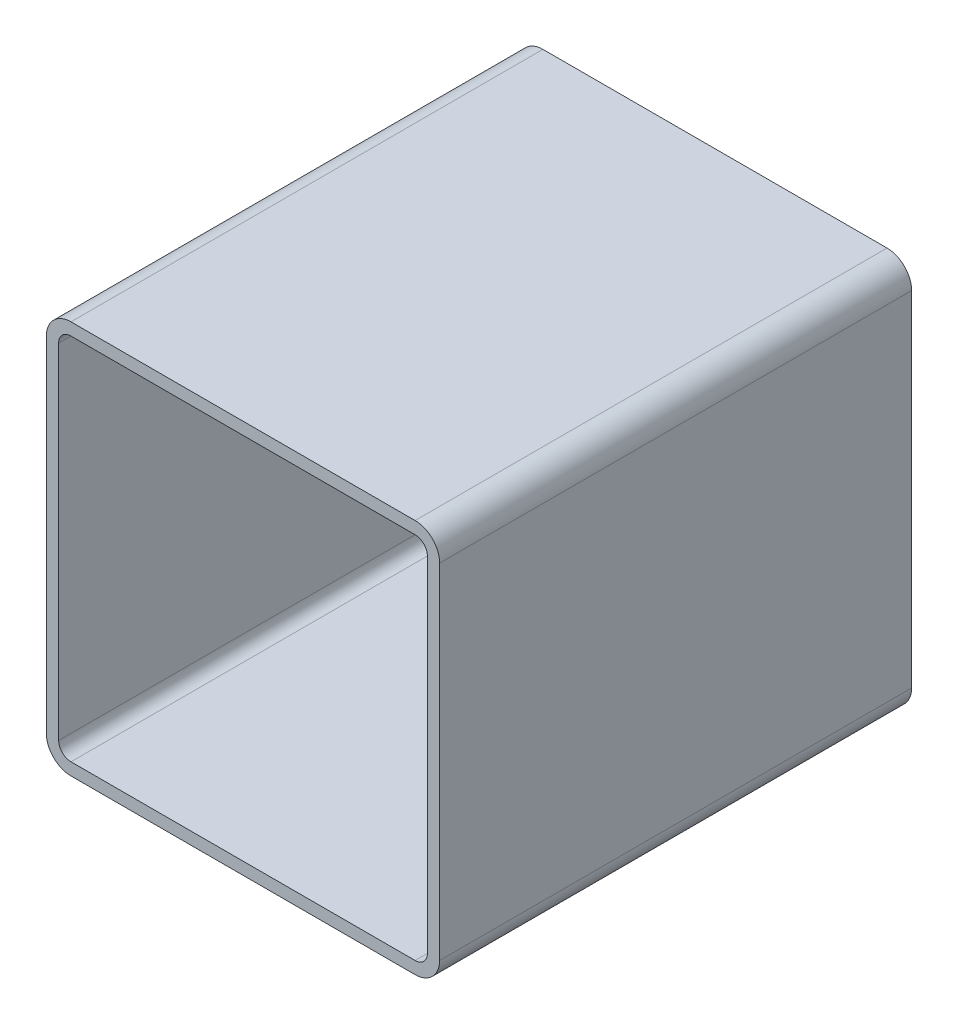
ISO-10303-21;
HEADER;
FILE_DESCRIPTION(('STEP AP214'),'2;1');
FILE_NAME('part.step','',(''),(''),'','','');
FILE_SCHEMA(('AUTOMOTIVE_DESIGN { 1 0 10303 214 1 1 1 1 }'));
ENDSEC;
DATA;
#1=APPLICATION_CONTEXT('core data for automotive mechanical design processes');
#2=APPLICATION_PROTOCOL_DEFINITION('international standard','automotive_design',2000,#1);
#3=PRODUCT_CONTEXT('',#1,'mechanical');
#4=PRODUCT('Part','Part','',(#3));
#5=PRODUCT_RELATED_PRODUCT_CATEGORY('part','',(#4));
#6=PRODUCT_DEFINITION_FORMATION('','',#4);
#7=PRODUCT_DEFINITION_CONTEXT('part definition',#1,'design');
#8=PRODUCT_DEFINITION('design','',#6,#7);
#9=PRODUCT_DEFINITION_SHAPE('','',#8);
#10=(LENGTH_UNIT() NAMED_UNIT(*) SI_UNIT(.MILLI.,.METRE.));
#11=(NAMED_UNIT(*) PLANE_ANGLE_UNIT() SI_UNIT($,.RADIAN.));
#12=(NAMED_UNIT(*) SI_UNIT($,.STERADIAN.) SOLID_ANGLE_UNIT());
#13=UNCERTAINTY_MEASURE_WITH_UNIT(LENGTH_MEASURE(1.E-05),#10,'distance_accuracy_value','');
#14=(GEOMETRIC_REPRESENTATION_CONTEXT(3) GLOBAL_UNCERTAINTY_ASSIGNED_CONTEXT((#13)) GLOBAL_UNIT_ASSIGNED_CONTEXT((#10,
#11,#12)) REPRESENTATION_CONTEXT('',''));
#15=CARTESIAN_POINT('',(0.,0.,0.));
#16=DIRECTION('',(0.,0.,1.));
#17=DIRECTION('',(1.,0.,0.));
#18=AXIS2_PLACEMENT_3D('',#15,#16,#17);
#19=CARTESIAN_POINT('',(18.6095794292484,240.045313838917,304.8));
#20=DIRECTION('',(0.,0.,1.));
#21=DIRECTION('',(1.,0.,0.));
#22=AXIS2_PLACEMENT_3D('',#19,#20,#21);
#23=PLANE('',#22);
#24=CARTESIAN_POINT('',(18.6095794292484,240.045313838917,304.8));
#25=DIRECTION('',(0.,0.,1.));
#26=DIRECTION('',(1.,0.,0.));
#27=AXIS2_PLACEMENT_3D('',#24,#25,#26);
#28=CIRCLE('',#27,15.875);
#29=CARTESIAN_POINT('',(18.6095794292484,255.920313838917,304.8));
#30=VERTEX_POINT('',#29);
#31=CARTESIAN_POINT('',(2.73457942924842,240.045313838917,304.8));
#32=VERTEX_POINT('',#31);
#33=EDGE_CURVE('E211',#30,#32,#28,.T.);
#34=ORIENTED_EDGE('',*,*,#33,.T.);
#35=DIRECTION('',(0.,-1.,0.));
#36=VECTOR('',#35,1.);
#37=CARTESIAN_POINT('',(2.73457942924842,17.7953138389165,304.8));
#38=LINE('',#37,#36);
#39=CARTESIAN_POINT('',(2.73457942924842,17.7953138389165,304.8));
#40=VERTEX_POINT('',#39);
#41=EDGE_CURVE('E214',#32,#40,#38,.T.);
#42=ORIENTED_EDGE('',*,*,#41,.T.);
#43=CARTESIAN_POINT('',(18.6095794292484,17.7953138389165,304.8));
#44=DIRECTION('',(0.,0.,1.));
#45=DIRECTION('',(1.,0.,0.));
#46=AXIS2_PLACEMENT_3D('',#43,#44,#45);
#47=CIRCLE('',#46,15.875);
#48=CARTESIAN_POINT('',(18.6095794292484,1.92031383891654,304.8));
#49=VERTEX_POINT('',#48);
#50=EDGE_CURVE('E217',#40,#49,#47,.T.);
#51=ORIENTED_EDGE('',*,*,#50,.T.);
#52=DIRECTION('',(1.,0.,0.));
#53=VECTOR('',#52,1.);
#54=CARTESIAN_POINT('',(240.859579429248,1.92031383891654,304.8));
#55=LINE('',#54,#53);
#56=CARTESIAN_POINT('',(240.859579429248,1.92031383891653,304.8));
#57=VERTEX_POINT('',#56);
#58=EDGE_CURVE('E219',#49,#57,#55,.T.);
#59=ORIENTED_EDGE('',*,*,#58,.T.);
#60=CARTESIAN_POINT('',(240.859579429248,17.7953138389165,304.8));
#61=DIRECTION('',(0.,0.,1.));
#62=DIRECTION('',(1.,0.,0.));
#63=AXIS2_PLACEMENT_3D('',#60,#61,#62);
#64=CIRCLE('',#63,15.875);
#65=CARTESIAN_POINT('',(256.734579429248,17.7953138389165,304.8));
#66=VERTEX_POINT('',#65);
#67=EDGE_CURVE('E221',#57,#66,#64,.T.);
#68=ORIENTED_EDGE('',*,*,#67,.T.);
#69=DIRECTION('',(0.,1.,0.));
#70=VECTOR('',#69,1.);
#71=CARTESIAN_POINT('',(256.734579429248,240.045313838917,304.8));
#72=LINE('',#71,#70);
#73=CARTESIAN_POINT('',(256.734579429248,240.045313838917,304.8));
#74=VERTEX_POINT('',#73);
#75=EDGE_CURVE('E223',#66,#74,#72,.T.);
#76=ORIENTED_EDGE('',*,*,#75,.T.);
#77=CARTESIAN_POINT('',(240.859579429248,240.045313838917,304.8));
#78=DIRECTION('',(0.,0.,1.));
#79=DIRECTION('',(1.,0.,0.));
#80=AXIS2_PLACEMENT_3D('',#77,#78,#79);
#81=CIRCLE('',#80,15.875);
#82=CARTESIAN_POINT('',(240.859579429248,255.920313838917,304.8));
#83=VERTEX_POINT('',#82);
#84=EDGE_CURVE('E225',#74,#83,#81,.T.);
#85=ORIENTED_EDGE('',*,*,#84,.T.);
#86=DIRECTION('',(-1.,0.,0.));
#87=VECTOR('',#86,1.);
#88=CARTESIAN_POINT('',(18.6095794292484,255.920313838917,304.8));
#89=LINE('',#88,#87);
#90=EDGE_CURVE('E227',#83,#30,#89,.T.);
#91=ORIENTED_EDGE('',*,*,#90,.T.);
#92=EDGE_LOOP('',(#34,#42,#51,#59,#68,#76,#85,#91));
#93=FACE_BOUND('',#92,.T.);
#94=DIRECTION('',(0.,-1.,0.));
#95=VECTOR('',#94,1.);
#96=CARTESIAN_POINT('',(10.6720794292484,17.7953138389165,304.8));
#97=LINE('',#96,#95);
#98=CARTESIAN_POINT('',(10.6720794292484,240.045313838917,304.8));
#99=VERTEX_POINT('',#98);
#100=CARTESIAN_POINT('',(10.6720794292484,17.7953138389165,304.8));
#101=VERTEX_POINT('',#100);
#102=EDGE_CURVE('E154',#99,#101,#97,.T.);
#103=ORIENTED_EDGE('',*,*,#102,.F.);
#104=CARTESIAN_POINT('',(18.6095794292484,240.045313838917,304.8));
#105=DIRECTION('',(0.,0.,1.));
#106=DIRECTION('',(1.,0.,0.));
#107=AXIS2_PLACEMENT_3D('',#104,#105,#106);
#108=CIRCLE('',#107,7.9375);
#109=CARTESIAN_POINT('',(18.6095794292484,247.982813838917,304.8));
#110=VERTEX_POINT('',#109);
#111=EDGE_CURVE('E146',#110,#99,#108,.T.);
#112=ORIENTED_EDGE('',*,*,#111,.F.);
#113=DIRECTION('',(-1.,0.,0.));
#114=VECTOR('',#113,1.);
#115=CARTESIAN_POINT('',(18.6095794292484,247.982813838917,304.8));
#116=LINE('',#115,#114);
#117=CARTESIAN_POINT('',(240.859579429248,247.982813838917,304.8));
#118=VERTEX_POINT('',#117);
#119=EDGE_CURVE('E179',#118,#110,#116,.T.);
#120=ORIENTED_EDGE('',*,*,#119,.F.);
#121=CARTESIAN_POINT('',(240.859579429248,240.045313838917,304.8));
#122=DIRECTION('',(0.,0.,1.));
#123=DIRECTION('',(1.,0.,0.));
#124=AXIS2_PLACEMENT_3D('',#121,#122,#123);
#125=CIRCLE('',#124,7.9375);
#126=CARTESIAN_POINT('',(248.797079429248,240.045313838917,304.8));
#127=VERTEX_POINT('',#126);
#128=EDGE_CURVE('E177',#127,#118,#125,.T.);
#129=ORIENTED_EDGE('',*,*,#128,.F.);
#130=DIRECTION('',(0.,1.,0.));
#131=VECTOR('',#130,1.);
#132=CARTESIAN_POINT('',(248.797079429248,240.045313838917,304.8));
#133=LINE('',#132,#131);
#134=CARTESIAN_POINT('',(248.797079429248,17.7953138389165,304.8));
#135=VERTEX_POINT('',#134);
#136=EDGE_CURVE('E175',#135,#127,#133,.T.);
#137=ORIENTED_EDGE('',*,*,#136,.F.);
#138=CARTESIAN_POINT('',(240.859579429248,17.7953138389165,304.8));
#139=DIRECTION('',(0.,0.,1.));
#140=DIRECTION('',(1.,0.,0.));
#141=AXIS2_PLACEMENT_3D('',#138,#139,#140);
#142=CIRCLE('',#141,7.93750000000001);
#143=CARTESIAN_POINT('',(240.859579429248,9.85781383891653,304.8));
#144=VERTEX_POINT('',#143);
#145=EDGE_CURVE('E173',#144,#135,#142,.T.);
#146=ORIENTED_EDGE('',*,*,#145,.F.);
#147=DIRECTION('',(1.,0.,0.));
#148=VECTOR('',#147,1.);
#149=CARTESIAN_POINT('',(240.859579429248,9.85781383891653,304.8));
#150=LINE('',#149,#148);
#151=CARTESIAN_POINT('',(18.6095794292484,9.85781383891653,304.8));
#152=VERTEX_POINT('',#151);
#153=EDGE_CURVE('E169',#152,#144,#150,.T.);
#154=ORIENTED_EDGE('',*,*,#153,.F.);
#155=CARTESIAN_POINT('',(18.6095794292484,17.7953138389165,304.8));
#156=DIRECTION('',(0.,0.,1.));
#157=DIRECTION('',(1.,0.,0.));
#158=AXIS2_PLACEMENT_3D('',#155,#156,#157);
#159=CIRCLE('',#158,7.9375);
#160=EDGE_CURVE('E167',#101,#152,#159,.T.);
#161=ORIENTED_EDGE('',*,*,#160,.F.);
#162=EDGE_LOOP('',(#103,#112,#120,#129,#137,#146,#154,#161));
#163=FACE_BOUND('',#162,.T.);
#164=ADVANCED_FACE('F33',(#93,#163),#23,.T.);
#165=CARTESIAN_POINT('',(18.6095794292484,240.045313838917,0.));
#166=DIRECTION('',(0.,0.,1.));
#167=DIRECTION('',(1.,0.,0.));
#168=AXIS2_PLACEMENT_3D('',#165,#166,#167);
#169=PLANE('',#168);
#170=CARTESIAN_POINT('',(18.6095794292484,240.045313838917,0.));
#171=DIRECTION('',(0.,0.,1.));
#172=DIRECTION('',(1.,0.,0.));
#173=AXIS2_PLACEMENT_3D('',#170,#171,#172);
#174=CIRCLE('',#173,15.875);
#175=CARTESIAN_POINT('',(18.6095794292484,255.920313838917,0.));
#176=VERTEX_POINT('',#175);
#177=CARTESIAN_POINT('',(2.73457942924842,240.045313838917,0.));
#178=VERTEX_POINT('',#177);
#179=EDGE_CURVE('E162',#176,#178,#174,.T.);
#180=ORIENTED_EDGE('',*,*,#179,.F.);
#181=DIRECTION('',(-1.,0.,0.));
#182=VECTOR('',#181,1.);
#183=CARTESIAN_POINT('',(18.6095794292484,255.920313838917,0.));
#184=LINE('',#183,#182);
#185=CARTESIAN_POINT('',(240.859579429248,255.920313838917,0.));
#186=VERTEX_POINT('',#185);
#187=EDGE_CURVE('E215',#186,#176,#184,.T.);
#188=ORIENTED_EDGE('',*,*,#187,.F.);
#189=CARTESIAN_POINT('',(240.859579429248,240.045313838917,0.));
#190=DIRECTION('',(0.,0.,1.));
#191=DIRECTION('',(1.,0.,0.));
#192=AXIS2_PLACEMENT_3D('',#189,#190,#191);
#193=CIRCLE('',#192,15.875);
#194=CARTESIAN_POINT('',(256.734579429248,240.045313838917,0.));
#195=VERTEX_POINT('',#194);
#196=EDGE_CURVE('E242',#195,#186,#193,.T.);
#197=ORIENTED_EDGE('',*,*,#196,.F.);
#198=DIRECTION('',(0.,1.,0.));
#199=VECTOR('',#198,1.);
#200=CARTESIAN_POINT('',(256.734579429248,240.045313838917,0.));
#201=LINE('',#200,#199);
#202=CARTESIAN_POINT('',(256.734579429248,17.7953138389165,0.));
#203=VERTEX_POINT('',#202);
#204=EDGE_CURVE('E240',#203,#195,#201,.T.);
#205=ORIENTED_EDGE('',*,*,#204,.F.);
#206=CARTESIAN_POINT('',(240.859579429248,17.7953138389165,0.));
#207=DIRECTION('',(0.,0.,1.));
#208=DIRECTION('',(1.,0.,0.));
#209=AXIS2_PLACEMENT_3D('',#206,#207,#208);
#210=CIRCLE('',#209,15.875);
#211=CARTESIAN_POINT('',(240.859579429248,1.92031383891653,0.));
#212=VERTEX_POINT('',#211);
#213=EDGE_CURVE('E238',#212,#203,#210,.T.);
#214=ORIENTED_EDGE('',*,*,#213,.F.);
#215=DIRECTION('',(1.,0.,0.));
#216=VECTOR('',#215,1.);
#217=CARTESIAN_POINT('',(240.859579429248,1.92031383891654,0.));
#218=LINE('',#217,#216);
#219=CARTESIAN_POINT('',(18.6095794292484,1.92031383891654,0.));
#220=VERTEX_POINT('',#219);
#221=EDGE_CURVE('E236',#220,#212,#218,.T.);
#222=ORIENTED_EDGE('',*,*,#221,.F.);
#223=CARTESIAN_POINT('',(18.6095794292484,17.7953138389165,0.));
#224=DIRECTION('',(0.,0.,1.));
#225=DIRECTION('',(1.,0.,0.));
#226=AXIS2_PLACEMENT_3D('',#223,#224,#225);
#227=CIRCLE('',#226,15.875);
#228=CARTESIAN_POINT('',(2.73457942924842,17.7953138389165,0.));
#229=VERTEX_POINT('',#228);
#230=EDGE_CURVE('E234',#229,#220,#227,.T.);
#231=ORIENTED_EDGE('',*,*,#230,.F.);
#232=DIRECTION('',(0.,-1.,0.));
#233=VECTOR('',#232,1.);
#234=CARTESIAN_POINT('',(2.73457942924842,17.7953138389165,0.));
#235=LINE('',#234,#233);
#236=EDGE_CURVE('E232',#178,#229,#235,.T.);
#237=ORIENTED_EDGE('',*,*,#236,.F.);
#238=EDGE_LOOP('',(#180,#188,#197,#205,#214,#222,#231,#237));
#239=FACE_BOUND('',#238,.T.);
#240=CARTESIAN_POINT('',(18.6095794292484,240.045313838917,0.));
#241=DIRECTION('',(0.,0.,1.));
#242=DIRECTION('',(1.,0.,0.));
#243=AXIS2_PLACEMENT_3D('',#240,#241,#242);
#244=CIRCLE('',#243,7.9375);
#245=CARTESIAN_POINT('',(18.6095794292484,247.982813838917,0.));
#246=VERTEX_POINT('',#245);
#247=CARTESIAN_POINT('',(10.6720794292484,240.045313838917,0.));
#248=VERTEX_POINT('',#247);
#249=EDGE_CURVE('E56',#246,#248,#244,.T.);
#250=ORIENTED_EDGE('',*,*,#249,.T.);
#251=DIRECTION('',(0.,-1.,0.));
#252=VECTOR('',#251,1.);
#253=CARTESIAN_POINT('',(10.6720794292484,17.7953138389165,0.));
#254=LINE('',#253,#252);
#255=CARTESIAN_POINT('',(10.6720794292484,17.7953138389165,0.));
#256=VERTEX_POINT('',#255);
#257=EDGE_CURVE('E161',#248,#256,#254,.T.);
#258=ORIENTED_EDGE('',*,*,#257,.T.);
#259=CARTESIAN_POINT('',(18.6095794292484,17.7953138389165,0.));
#260=DIRECTION('',(0.,0.,1.));
#261=DIRECTION('',(1.,0.,0.));
#262=AXIS2_PLACEMENT_3D('',#259,#260,#261);
#263=CIRCLE('',#262,7.9375);
#264=CARTESIAN_POINT('',(18.6095794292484,9.85781383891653,0.));
#265=VERTEX_POINT('',#264);
#266=EDGE_CURVE('E183',#256,#265,#263,.T.);
#267=ORIENTED_EDGE('',*,*,#266,.T.);
#268=DIRECTION('',(1.,0.,0.));
#269=VECTOR('',#268,1.);
#270=CARTESIAN_POINT('',(240.859579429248,9.85781383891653,0.));
#271=LINE('',#270,#269);
#272=CARTESIAN_POINT('',(240.859579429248,9.85781383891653,0.));
#273=VERTEX_POINT('',#272);
#274=EDGE_CURVE('E186',#265,#273,#271,.T.);
#275=ORIENTED_EDGE('',*,*,#274,.T.);
#276=CARTESIAN_POINT('',(240.859579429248,17.7953138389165,0.));
#277=DIRECTION('',(0.,0.,1.));
#278=DIRECTION('',(1.,0.,0.));
#279=AXIS2_PLACEMENT_3D('',#276,#277,#278);
#280=CIRCLE('',#279,7.93750000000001);
#281=CARTESIAN_POINT('',(248.797079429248,17.7953138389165,0.));
#282=VERTEX_POINT('',#281);
#283=EDGE_CURVE('E189',#273,#282,#280,.T.);
#284=ORIENTED_EDGE('',*,*,#283,.T.);
#285=DIRECTION('',(0.,1.,0.));
#286=VECTOR('',#285,1.);
#287=CARTESIAN_POINT('',(248.797079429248,240.045313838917,0.));
#288=LINE('',#287,#286);
#289=CARTESIAN_POINT('',(248.797079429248,240.045313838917,0.));
#290=VERTEX_POINT('',#289);
#291=EDGE_CURVE('E192',#282,#290,#288,.T.);
#292=ORIENTED_EDGE('',*,*,#291,.T.);
#293=CARTESIAN_POINT('',(240.859579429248,240.045313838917,0.));
#294=DIRECTION('',(0.,0.,1.));
#295=DIRECTION('',(1.,0.,0.));
#296=AXIS2_PLACEMENT_3D('',#293,#294,#295);
#297=CIRCLE('',#296,7.9375);
#298=CARTESIAN_POINT('',(240.859579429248,247.982813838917,0.));
#299=VERTEX_POINT('',#298);
#300=EDGE_CURVE('E195',#290,#299,#297,.T.);
#301=ORIENTED_EDGE('',*,*,#300,.T.);
#302=DIRECTION('',(-1.,0.,0.));
#303=VECTOR('',#302,1.);
#304=CARTESIAN_POINT('',(18.6095794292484,247.982813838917,0.));
#305=LINE('',#304,#303);
#306=EDGE_CURVE('E155',#299,#246,#305,.T.);
#307=ORIENTED_EDGE('',*,*,#306,.T.);
#308=EDGE_LOOP('',(#250,#258,#267,#275,#284,#292,#301,#307));
#309=FACE_BOUND('',#308,.T.);
#310=ADVANCED_FACE('F272',(#239,#309),#169,.F.);
#311=CARTESIAN_POINT('',(18.6095794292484,240.045313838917,304.8));
#312=DIRECTION('',(0.,0.,-1.));
#313=DIRECTION('',(-1.,0.,0.));
#314=AXIS2_PLACEMENT_3D('',#311,#312,#313);
#315=CYLINDRICAL_SURFACE('',#314,15.875);
#316=ORIENTED_EDGE('',*,*,#179,.T.);
#317=DIRECTION('',(0.,0.,-1.));
#318=VECTOR('',#317,1.);
#319=CARTESIAN_POINT('',(2.73457942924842,240.045313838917,304.8));
#320=LINE('',#319,#318);
#321=EDGE_CURVE('E11',#32,#178,#320,.T.);
#322=ORIENTED_EDGE('',*,*,#321,.F.);
#323=ORIENTED_EDGE('',*,*,#33,.F.);
#324=DIRECTION('',(0.,0.,-1.));
#325=VECTOR('',#324,1.);
#326=CARTESIAN_POINT('',(18.6095794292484,255.920313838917,304.8));
#327=LINE('',#326,#325);
#328=EDGE_CURVE('E229',#30,#176,#327,.T.);
#329=ORIENTED_EDGE('',*,*,#328,.T.);
#330=EDGE_LOOP('',(#316,#322,#323,#329));
#331=FACE_BOUND('',#330,.T.);
#332=ADVANCED_FACE('F35',(#331),#315,.T.);
#333=CARTESIAN_POINT('',(2.73457942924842,17.7953138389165,304.8));
#334=DIRECTION('',(1.,0.,0.));
#335=DIRECTION('',(0.,0.,-1.));
#336=AXIS2_PLACEMENT_3D('',#333,#334,#335);
#337=PLANE('',#336);
#338=ORIENTED_EDGE('',*,*,#236,.T.);
#339=DIRECTION('',(0.,0.,-1.));
#340=VECTOR('',#339,1.);
#341=CARTESIAN_POINT('',(2.73457942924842,17.7953138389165,304.8));
#342=LINE('',#341,#340);
#343=EDGE_CURVE('E41',#40,#229,#342,.T.);
#344=ORIENTED_EDGE('',*,*,#343,.F.);
#345=ORIENTED_EDGE('',*,*,#41,.F.);
#346=ORIENTED_EDGE('',*,*,#321,.T.);
#347=EDGE_LOOP('',(#338,#344,#345,#346));
#348=FACE_BOUND('',#347,.T.);
#349=ADVANCED_FACE('F289',(#348),#337,.F.);
#350=CARTESIAN_POINT('',(18.6095794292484,17.7953138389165,304.8));
#351=DIRECTION('',(0.,0.,-1.));
#352=DIRECTION('',(-1.,0.,0.));
#353=AXIS2_PLACEMENT_3D('',#350,#351,#352);
#354=CYLINDRICAL_SURFACE('',#353,15.875);
#355=ORIENTED_EDGE('',*,*,#230,.T.);
#356=DIRECTION('',(0.,0.,-1.));
#357=VECTOR('',#356,1.);
#358=CARTESIAN_POINT('',(18.6095794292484,1.92031383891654,304.8));
#359=LINE('',#358,#357);
#360=EDGE_CURVE('E259',#49,#220,#359,.T.);
#361=ORIENTED_EDGE('',*,*,#360,.F.);
#362=ORIENTED_EDGE('',*,*,#50,.F.);
#363=ORIENTED_EDGE('',*,*,#343,.T.);
#364=EDGE_LOOP('',(#355,#361,#362,#363));
#365=FACE_BOUND('',#364,.T.);
#366=ADVANCED_FACE('F266',(#365),#354,.T.);
#367=CARTESIAN_POINT('',(240.859579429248,1.92031383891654,304.8));
#368=DIRECTION('',(0.,1.,0.));
#369=DIRECTION('',(0.,0.,1.));
#370=AXIS2_PLACEMENT_3D('',#367,#368,#369);
#371=PLANE('',#370);
#372=ORIENTED_EDGE('',*,*,#221,.T.);
#373=DIRECTION('',(0.,0.,-1.));
#374=VECTOR('',#373,1.);
#375=CARTESIAN_POINT('',(240.859579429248,1.92031383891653,304.8));
#376=LINE('',#375,#374);
#377=EDGE_CURVE('E256',#57,#212,#376,.T.);
#378=ORIENTED_EDGE('',*,*,#377,.F.);
#379=ORIENTED_EDGE('',*,*,#58,.F.);
#380=ORIENTED_EDGE('',*,*,#360,.T.);
#381=EDGE_LOOP('',(#372,#378,#379,#380));
#382=FACE_BOUND('',#381,.T.);
#383=ADVANCED_FACE('F278',(#382),#371,.F.);
#384=CARTESIAN_POINT('',(240.859579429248,17.7953138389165,304.8));
#385=DIRECTION('',(0.,0.,-1.));
#386=DIRECTION('',(-1.,0.,0.));
#387=AXIS2_PLACEMENT_3D('',#384,#385,#386);
#388=CYLINDRICAL_SURFACE('',#387,15.875);
#389=ORIENTED_EDGE('',*,*,#213,.T.);
#390=DIRECTION('',(0.,0.,-1.));
#391=VECTOR('',#390,1.);
#392=CARTESIAN_POINT('',(256.734579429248,17.7953138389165,304.8));
#393=LINE('',#392,#391);
#394=EDGE_CURVE('E253',#66,#203,#393,.T.);
#395=ORIENTED_EDGE('',*,*,#394,.F.);
#396=ORIENTED_EDGE('',*,*,#67,.F.);
#397=ORIENTED_EDGE('',*,*,#377,.T.);
#398=EDGE_LOOP('',(#389,#395,#396,#397));
#399=FACE_BOUND('',#398,.T.);
#400=ADVANCED_FACE('F282',(#399),#388,.T.);
#401=CARTESIAN_POINT('',(256.734579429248,240.045313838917,304.8));
#402=DIRECTION('',(-1.,0.,0.));
#403=DIRECTION('',(0.,0.,1.));
#404=AXIS2_PLACEMENT_3D('',#401,#402,#403);
#405=PLANE('',#404);
#406=ORIENTED_EDGE('',*,*,#204,.T.);
#407=DIRECTION('',(0.,0.,-1.));
#408=VECTOR('',#407,1.);
#409=CARTESIAN_POINT('',(256.734579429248,240.045313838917,304.8));
#410=LINE('',#409,#408);
#411=EDGE_CURVE('E250',#74,#195,#410,.T.);
#412=ORIENTED_EDGE('',*,*,#411,.F.);
#413=ORIENTED_EDGE('',*,*,#75,.F.);
#414=ORIENTED_EDGE('',*,*,#394,.T.);
#415=EDGE_LOOP('',(#406,#412,#413,#414));
#416=FACE_BOUND('',#415,.T.);
#417=ADVANCED_FACE('F302',(#416),#405,.F.);
#418=CARTESIAN_POINT('',(240.859579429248,240.045313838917,304.8));
#419=DIRECTION('',(0.,0.,-1.));
#420=DIRECTION('',(-1.,0.,0.));
#421=AXIS2_PLACEMENT_3D('',#418,#419,#420);
#422=CYLINDRICAL_SURFACE('',#421,15.875);
#423=ORIENTED_EDGE('',*,*,#196,.T.);
#424=DIRECTION('',(0.,0.,-1.));
#425=VECTOR('',#424,1.);
#426=CARTESIAN_POINT('',(240.859579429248,255.920313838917,304.8));
#427=LINE('',#426,#425);
#428=EDGE_CURVE('E247',#83,#186,#427,.T.);
#429=ORIENTED_EDGE('',*,*,#428,.F.);
#430=ORIENTED_EDGE('',*,*,#84,.F.);
#431=ORIENTED_EDGE('',*,*,#411,.T.);
#432=EDGE_LOOP('',(#423,#429,#430,#431));
#433=FACE_BOUND('',#432,.T.);
#434=ADVANCED_FACE('F300',(#433),#422,.T.);
#435=CARTESIAN_POINT('',(18.6095794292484,255.920313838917,304.8));
#436=DIRECTION('',(0.,-1.,0.));
#437=DIRECTION('',(0.,0.,-1.));
#438=AXIS2_PLACEMENT_3D('',#435,#436,#437);
#439=PLANE('',#438);
#440=ORIENTED_EDGE('',*,*,#187,.T.);
#441=ORIENTED_EDGE('',*,*,#328,.F.);
#442=ORIENTED_EDGE('',*,*,#90,.F.);
#443=ORIENTED_EDGE('',*,*,#428,.T.);
#444=EDGE_LOOP('',(#440,#441,#442,#443));
#445=FACE_BOUND('',#444,.T.);
#446=ADVANCED_FACE('F295',(#445),#439,.F.);
#447=CARTESIAN_POINT('',(18.6095794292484,240.045313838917,304.8));
#448=DIRECTION('',(0.,0.,-1.));
#449=DIRECTION('',(-1.,0.,0.));
#450=AXIS2_PLACEMENT_3D('',#447,#448,#449);
#451=CYLINDRICAL_SURFACE('',#450,7.9375);
#452=ORIENTED_EDGE('',*,*,#249,.F.);
#453=DIRECTION('',(0.,0.,-1.));
#454=VECTOR('',#453,1.);
#455=CARTESIAN_POINT('',(18.6095794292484,247.982813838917,304.8));
#456=LINE('',#455,#454);
#457=EDGE_CURVE('E150',#110,#246,#456,.T.);
#458=ORIENTED_EDGE('',*,*,#457,.F.);
#459=ORIENTED_EDGE('',*,*,#111,.T.);
#460=DIRECTION('',(0.,0.,-1.));
#461=VECTOR('',#460,1.);
#462=CARTESIAN_POINT('',(10.6720794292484,240.045313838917,304.8));
#463=LINE('',#462,#461);
#464=EDGE_CURVE('E149',#99,#248,#463,.T.);
#465=ORIENTED_EDGE('',*,*,#464,.T.);
#466=EDGE_LOOP('',(#452,#458,#459,#465));
#467=FACE_BOUND('',#466,.T.);
#468=ADVANCED_FACE('F148',(#467),#451,.F.);
#469=CARTESIAN_POINT('',(10.6720794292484,17.7953138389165,304.8));
#470=DIRECTION('',(1.,0.,0.));
#471=DIRECTION('',(0.,0.,-1.));
#472=AXIS2_PLACEMENT_3D('',#469,#470,#471);
#473=PLANE('',#472);
#474=ORIENTED_EDGE('',*,*,#257,.F.);
#475=ORIENTED_EDGE('',*,*,#464,.F.);
#476=ORIENTED_EDGE('',*,*,#102,.T.);
#477=DIRECTION('',(0.,0.,-1.));
#478=VECTOR('',#477,1.);
#479=CARTESIAN_POINT('',(10.6720794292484,17.7953138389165,304.8));
#480=LINE('',#479,#478);
#481=EDGE_CURVE('E163',#101,#256,#480,.T.);
#482=ORIENTED_EDGE('',*,*,#481,.T.);
#483=EDGE_LOOP('',(#474,#475,#476,#482));
#484=FACE_BOUND('',#483,.T.);
#485=ADVANCED_FACE('F158',(#484),#473,.T.);
#486=CARTESIAN_POINT('',(18.6095794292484,17.7953138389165,304.8));
#487=DIRECTION('',(0.,0.,-1.));
#488=DIRECTION('',(-1.,0.,0.));
#489=AXIS2_PLACEMENT_3D('',#486,#487,#488);
#490=CYLINDRICAL_SURFACE('',#489,7.9375);
#491=ORIENTED_EDGE('',*,*,#266,.F.);
#492=ORIENTED_EDGE('',*,*,#481,.F.);
#493=ORIENTED_EDGE('',*,*,#160,.T.);
#494=DIRECTION('',(0.,0.,-1.));
#495=VECTOR('',#494,1.);
#496=CARTESIAN_POINT('',(18.6095794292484,9.85781383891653,304.8));
#497=LINE('',#496,#495);
#498=EDGE_CURVE('E208',#152,#265,#497,.T.);
#499=ORIENTED_EDGE('',*,*,#498,.T.);
#500=EDGE_LOOP('',(#491,#492,#493,#499));
#501=FACE_BOUND('',#500,.T.);
#502=ADVANCED_FACE('F327',(#501),#490,.F.);
#503=CARTESIAN_POINT('',(240.859579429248,9.85781383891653,304.8));
#504=DIRECTION('',(0.,1.,0.));
#505=DIRECTION('',(0.,0.,1.));
#506=AXIS2_PLACEMENT_3D('',#503,#504,#505);
#507=PLANE('',#506);
#508=ORIENTED_EDGE('',*,*,#274,.F.);
#509=ORIENTED_EDGE('',*,*,#498,.F.);
#510=ORIENTED_EDGE('',*,*,#153,.T.);
#511=DIRECTION('',(0.,0.,-1.));
#512=VECTOR('',#511,1.);
#513=CARTESIAN_POINT('',(240.859579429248,9.85781383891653,304.8));
#514=LINE('',#513,#512);
#515=EDGE_CURVE('E206',#144,#273,#514,.T.);
#516=ORIENTED_EDGE('',*,*,#515,.T.);
#517=EDGE_LOOP('',(#508,#509,#510,#516));
#518=FACE_BOUND('',#517,.T.);
#519=ADVANCED_FACE('F331',(#518),#507,.T.);
#520=CARTESIAN_POINT('',(240.859579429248,17.7953138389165,304.8));
#521=DIRECTION('',(0.,0.,-1.));
#522=DIRECTION('',(-1.,0.,0.));
#523=AXIS2_PLACEMENT_3D('',#520,#521,#522);
#524=CYLINDRICAL_SURFACE('',#523,7.93750000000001);
#525=ORIENTED_EDGE('',*,*,#283,.F.);
#526=ORIENTED_EDGE('',*,*,#515,.F.);
#527=ORIENTED_EDGE('',*,*,#145,.T.);
#528=DIRECTION('',(0.,0.,-1.));
#529=VECTOR('',#528,1.);
#530=CARTESIAN_POINT('',(248.797079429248,17.7953138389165,304.8));
#531=LINE('',#530,#529);
#532=EDGE_CURVE('E204',#135,#282,#531,.T.);
#533=ORIENTED_EDGE('',*,*,#532,.T.);
#534=EDGE_LOOP('',(#525,#526,#527,#533));
#535=FACE_BOUND('',#534,.T.);
#536=ADVANCED_FACE('F337',(#535),#524,.F.);
#537=CARTESIAN_POINT('',(248.797079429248,240.045313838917,304.8));
#538=DIRECTION('',(-1.,0.,0.));
#539=DIRECTION('',(0.,0.,1.));
#540=AXIS2_PLACEMENT_3D('',#537,#538,#539);
#541=PLANE('',#540);
#542=ORIENTED_EDGE('',*,*,#291,.F.);
#543=ORIENTED_EDGE('',*,*,#532,.F.);
#544=ORIENTED_EDGE('',*,*,#136,.T.);
#545=DIRECTION('',(0.,0.,-1.));
#546=VECTOR('',#545,1.);
#547=CARTESIAN_POINT('',(248.797079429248,240.045313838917,304.8));
#548=LINE('',#547,#546);
#549=EDGE_CURVE('E202',#127,#290,#548,.T.);
#550=ORIENTED_EDGE('',*,*,#549,.T.);
#551=EDGE_LOOP('',(#542,#543,#544,#550));
#552=FACE_BOUND('',#551,.T.);
#553=ADVANCED_FACE('F341',(#552),#541,.T.);
#554=CARTESIAN_POINT('',(240.859579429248,240.045313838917,304.8));
#555=DIRECTION('',(0.,0.,-1.));
#556=DIRECTION('',(-1.,0.,0.));
#557=AXIS2_PLACEMENT_3D('',#554,#555,#556);
#558=CYLINDRICAL_SURFACE('',#557,7.9375);
#559=ORIENTED_EDGE('',*,*,#300,.F.);
#560=ORIENTED_EDGE('',*,*,#549,.F.);
#561=ORIENTED_EDGE('',*,*,#128,.T.);
#562=DIRECTION('',(0.,0.,-1.));
#563=VECTOR('',#562,1.);
#564=CARTESIAN_POINT('',(240.859579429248,247.982813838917,304.8));
#565=LINE('',#564,#563);
#566=EDGE_CURVE('E48',#118,#299,#565,.T.);
#567=ORIENTED_EDGE('',*,*,#566,.T.);
#568=EDGE_LOOP('',(#559,#560,#561,#567));
#569=FACE_BOUND('',#568,.T.);
#570=ADVANCED_FACE('F345',(#569),#558,.F.);
#571=CARTESIAN_POINT('',(18.6095794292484,247.982813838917,304.8));
#572=DIRECTION('',(0.,-1.,0.));
#573=DIRECTION('',(0.,0.,-1.));
#574=AXIS2_PLACEMENT_3D('',#571,#572,#573);
#575=PLANE('',#574);
#576=ORIENTED_EDGE('',*,*,#306,.F.);
#577=ORIENTED_EDGE('',*,*,#566,.F.);
#578=ORIENTED_EDGE('',*,*,#119,.T.);
#579=ORIENTED_EDGE('',*,*,#457,.T.);
#580=EDGE_LOOP('',(#576,#577,#578,#579));
#581=FACE_BOUND('',#580,.T.);
#582=ADVANCED_FACE('F349',(#581),#575,.T.);
#583=CLOSED_SHELL('',(#164,#310,#332,#349,#366,#383,#400,#417,#434,#446,#468,#485,#502,#519,
#536,#553,#570,#582));
#584=MANIFOLD_SOLID_BREP('B2',#583);
#585=ADVANCED_BREP_SHAPE_REPRESENTATION('',(#18,#584),#14);
#586=SHAPE_DEFINITION_REPRESENTATION(#9,#585);
ENDSEC;
END-ISO-10303-21;
